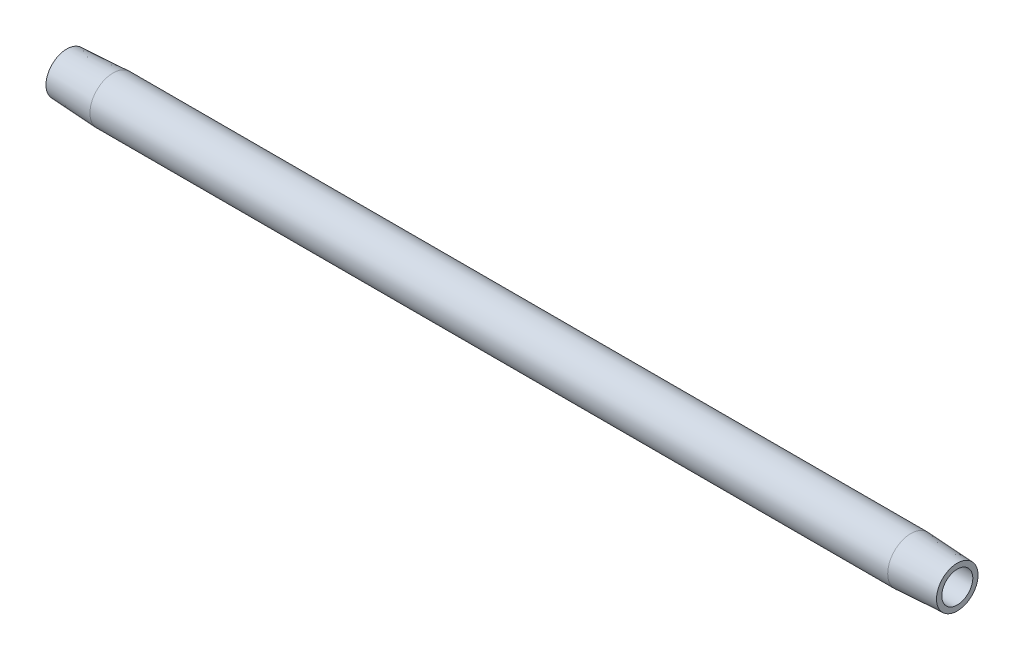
from build123d import *


with BuildPart() as part:
    # Sketch2 → Revolve1 (revolve)
    with BuildSketch(Plane.XY, mode=Mode.PRIVATE) as revolve1_sk:
        Polygon((7.9375, 3.96875), (0, 3.552763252), (0, 2.6543), (152.4, 2.6543), (152.4, 3.552763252), (144.4625, 3.96875), align=None)
    revolve(revolve1_sk.sketch.rotate(Axis((0.476141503, 0, 0), (1, 0, 0)), 90), axis=Axis((0.476141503, 0, 0), (1, 0, 0)))


solid = part.part
